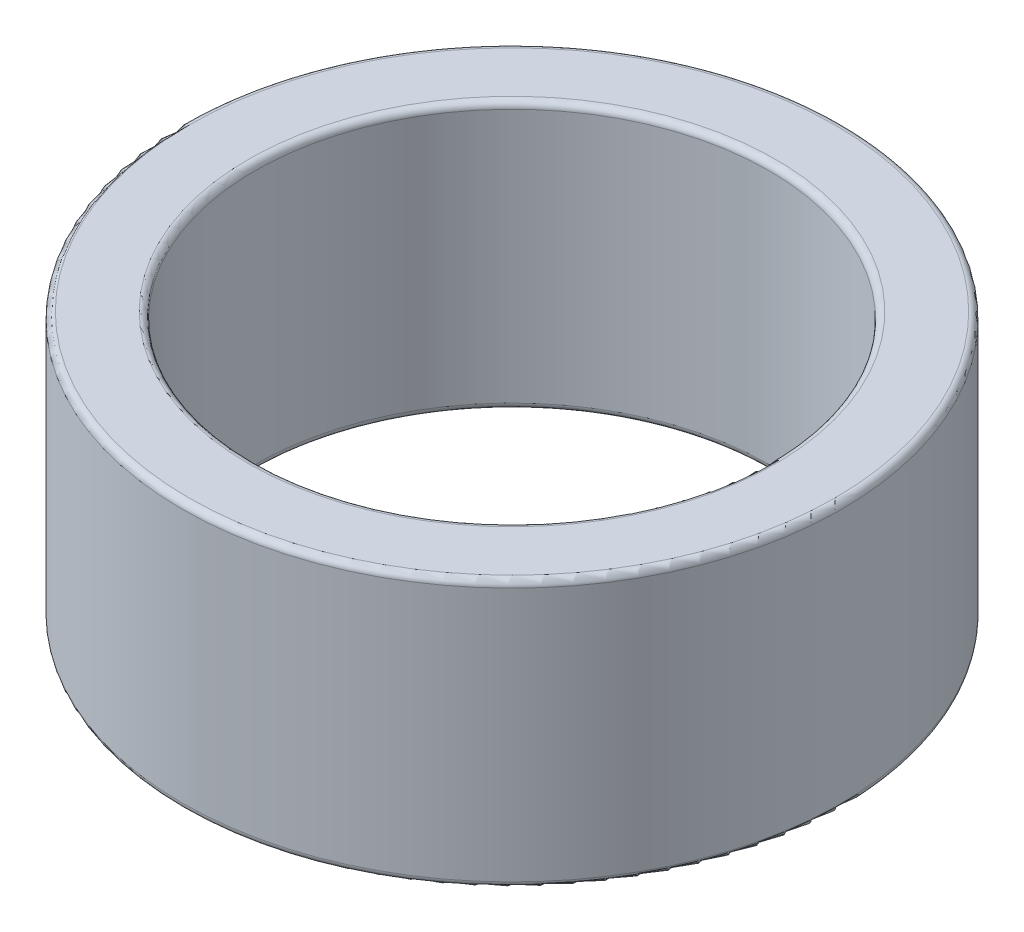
ISO-10303-21;
HEADER;
FILE_DESCRIPTION(('STEP AP214'),'2;1');
FILE_NAME('part.step','',(''),(''),'','','');
FILE_SCHEMA(('AUTOMOTIVE_DESIGN { 1 0 10303 214 1 1 1 1 }'));
ENDSEC;
DATA;
#1=APPLICATION_CONTEXT('core data for automotive mechanical design processes');
#2=APPLICATION_PROTOCOL_DEFINITION('international standard','automotive_design',2000,#1);
#3=PRODUCT_CONTEXT('',#1,'mechanical');
#4=PRODUCT('Part','Part','',(#3));
#5=PRODUCT_RELATED_PRODUCT_CATEGORY('part','',(#4));
#6=PRODUCT_DEFINITION_FORMATION('','',#4);
#7=PRODUCT_DEFINITION_CONTEXT('part definition',#1,'design');
#8=PRODUCT_DEFINITION('design','',#6,#7);
#9=PRODUCT_DEFINITION_SHAPE('','',#8);
#10=(LENGTH_UNIT() NAMED_UNIT(*) SI_UNIT(.MILLI.,.METRE.));
#11=(NAMED_UNIT(*) PLANE_ANGLE_UNIT() SI_UNIT($,.RADIAN.));
#12=(NAMED_UNIT(*) SI_UNIT($,.STERADIAN.) SOLID_ANGLE_UNIT());
#13=UNCERTAINTY_MEASURE_WITH_UNIT(LENGTH_MEASURE(1.E-05),#10,'distance_accuracy_value','');
#14=(GEOMETRIC_REPRESENTATION_CONTEXT(3) GLOBAL_UNCERTAINTY_ASSIGNED_CONTEXT((#13)) GLOBAL_UNIT_ASSIGNED_CONTEXT((#10,
#11,#12)) REPRESENTATION_CONTEXT('',''));
#15=CARTESIAN_POINT('',(0.,0.,0.));
#16=DIRECTION('',(0.,0.,1.));
#17=DIRECTION('',(1.,0.,0.));
#18=AXIS2_PLACEMENT_3D('',#15,#16,#17);
#19=CARTESIAN_POINT('',(0.,10.3124,0.));
#20=DIRECTION('',(0.,-1.,0.));
#21=DIRECTION('',(0.,0.,-1.));
#22=AXIS2_PLACEMENT_3D('',#19,#20,#21);
#23=CYLINDRICAL_SURFACE('',#22,12.7);
#24=CARTESIAN_POINT('',(0.,0.254000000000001,0.));
#25=DIRECTION('',(0.,1.,0.));
#26=DIRECTION('',(0.,0.,1.));
#27=AXIS2_PLACEMENT_3D('',#24,#25,#26);
#28=CIRCLE('',#27,12.7);
#29=CARTESIAN_POINT('',(0.,0.254000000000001,12.7));
#30=VERTEX_POINT('',#29);
#31=EDGE_CURVE('E59',#30,#30,#28,.T.);
#32=ORIENTED_EDGE('',*,*,#31,.T.);
#33=EDGE_LOOP('',(#32));
#34=FACE_BOUND('',#33,.T.);
#35=CARTESIAN_POINT('',(0.,10.0584,0.));
#36=DIRECTION('',(0.,1.,0.));
#37=DIRECTION('',(0.,0.,1.));
#38=AXIS2_PLACEMENT_3D('',#35,#36,#37);
#39=CIRCLE('',#38,12.7);
#40=CARTESIAN_POINT('',(0.,10.0584,12.7));
#41=VERTEX_POINT('',#40);
#42=EDGE_CURVE('E62',#41,#41,#39,.F.);
#43=ORIENTED_EDGE('',*,*,#42,.T.);
#44=EDGE_LOOP('',(#43));
#45=FACE_BOUND('',#44,.T.);
#46=ADVANCED_FACE('F34',(#34,#45),#23,.T.);
#47=CARTESIAN_POINT('',(0.,10.3124,0.));
#48=DIRECTION('',(0.,1.,0.));
#49=DIRECTION('',(0.,0.,1.));
#50=AXIS2_PLACEMENT_3D('',#47,#48,#49);
#51=PLANE('',#50);
#52=CARTESIAN_POINT('',(0.,10.3124,0.));
#53=DIRECTION('',(0.,1.,0.));
#54=DIRECTION('',(0.,0.,1.));
#55=AXIS2_PLACEMENT_3D('',#52,#53,#54);
#56=CIRCLE('',#55,10.16);
#57=CARTESIAN_POINT('',(0.,10.3124,10.16));
#58=VERTEX_POINT('',#57);
#59=EDGE_CURVE('E10',#58,#58,#56,.F.);
#60=ORIENTED_EDGE('',*,*,#59,.T.);
#61=EDGE_LOOP('',(#60));
#62=FACE_BOUND('',#61,.T.);
#63=CARTESIAN_POINT('',(0.,10.3124,0.));
#64=DIRECTION('',(0.,1.,0.));
#65=DIRECTION('',(0.,0.,1.));
#66=AXIS2_PLACEMENT_3D('',#63,#64,#65);
#67=CIRCLE('',#66,12.446);
#68=CARTESIAN_POINT('',(0.,10.3124,12.446));
#69=VERTEX_POINT('',#68);
#70=EDGE_CURVE('E40',#69,#69,#67,.T.);
#71=ORIENTED_EDGE('',*,*,#70,.T.);
#72=EDGE_LOOP('',(#71));
#73=FACE_BOUND('',#72,.T.);
#74=ADVANCED_FACE('F79',(#62,#73),#51,.T.);
#75=CARTESIAN_POINT('',(0.,0.,0.));
#76=DIRECTION('',(0.,1.,0.));
#77=DIRECTION('',(0.,0.,1.));
#78=AXIS2_PLACEMENT_3D('',#75,#76,#77);
#79=PLANE('',#78);
#80=CARTESIAN_POINT('',(0.,0.,0.));
#81=DIRECTION('',(0.,1.,0.));
#82=DIRECTION('',(0.,0.,1.));
#83=AXIS2_PLACEMENT_3D('',#80,#81,#82);
#84=CIRCLE('',#83,12.446);
#85=CARTESIAN_POINT('',(0.,0.,12.446));
#86=VERTEX_POINT('',#85);
#87=EDGE_CURVE('E53',#86,#86,#84,.F.);
#88=ORIENTED_EDGE('',*,*,#87,.T.);
#89=EDGE_LOOP('',(#88));
#90=FACE_BOUND('',#89,.T.);
#91=CARTESIAN_POINT('',(0.,0.,0.));
#92=DIRECTION('',(0.,1.,0.));
#93=DIRECTION('',(0.,0.,1.));
#94=AXIS2_PLACEMENT_3D('',#91,#92,#93);
#95=CIRCLE('',#94,10.16);
#96=CARTESIAN_POINT('',(0.,0.,10.16));
#97=VERTEX_POINT('',#96);
#98=EDGE_CURVE('E56',#97,#97,#95,.T.);
#99=ORIENTED_EDGE('',*,*,#98,.T.);
#100=EDGE_LOOP('',(#99));
#101=FACE_BOUND('',#100,.T.);
#102=ADVANCED_FACE('F84',(#90,#101),#79,.F.);
#103=CARTESIAN_POINT('',(0.,10.3124,0.));
#104=DIRECTION('',(0.,-1.,0.));
#105=DIRECTION('',(0.,0.,-1.));
#106=AXIS2_PLACEMENT_3D('',#103,#104,#105);
#107=CYLINDRICAL_SURFACE('',#106,9.906);
#108=CARTESIAN_POINT('',(0.,0.254000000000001,0.));
#109=DIRECTION('',(0.,1.,0.));
#110=DIRECTION('',(0.,0.,1.));
#111=AXIS2_PLACEMENT_3D('',#108,#109,#110);
#112=CIRCLE('',#111,9.906);
#113=CARTESIAN_POINT('',(0.,0.254000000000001,9.906));
#114=VERTEX_POINT('',#113);
#115=EDGE_CURVE('E44',#114,#114,#112,.F.);
#116=ORIENTED_EDGE('',*,*,#115,.T.);
#117=EDGE_LOOP('',(#116));
#118=FACE_BOUND('',#117,.T.);
#119=CARTESIAN_POINT('',(0.,10.0584,0.));
#120=DIRECTION('',(0.,1.,0.));
#121=DIRECTION('',(0.,0.,1.));
#122=AXIS2_PLACEMENT_3D('',#119,#120,#121);
#123=CIRCLE('',#122,9.906);
#124=CARTESIAN_POINT('',(0.,10.0584,9.906));
#125=VERTEX_POINT('',#124);
#126=EDGE_CURVE('E48',#125,#125,#123,.T.);
#127=ORIENTED_EDGE('',*,*,#126,.T.);
#128=EDGE_LOOP('',(#127));
#129=FACE_BOUND('',#128,.T.);
#130=ADVANCED_FACE('F89',(#118,#129),#107,.F.);
#131=CARTESIAN_POINT('',(0.,0.254000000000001,0.));
#132=DIRECTION('',(0.,1.,0.));
#133=DIRECTION('',(0.,0.,1.));
#134=AXIS2_PLACEMENT_3D('',#131,#132,#133);
#135=TOROIDAL_SURFACE('',#134,12.446,0.254);
#136=ORIENTED_EDGE('',*,*,#87,.F.);
#137=EDGE_LOOP('',(#136));
#138=FACE_BOUND('',#137,.T.);
#139=ORIENTED_EDGE('',*,*,#31,.F.);
#140=EDGE_LOOP('',(#139));
#141=FACE_BOUND('',#140,.T.);
#142=ADVANCED_FACE('F87',(#138,#141),#135,.T.);
#143=CARTESIAN_POINT('',(0.,0.254000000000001,0.));
#144=DIRECTION('',(0.,1.,0.));
#145=DIRECTION('',(0.,0.,1.));
#146=AXIS2_PLACEMENT_3D('',#143,#144,#145);
#147=TOROIDAL_SURFACE('',#146,10.16,0.254);
#148=ORIENTED_EDGE('',*,*,#98,.F.);
#149=EDGE_LOOP('',(#148));
#150=FACE_BOUND('',#149,.T.);
#151=ORIENTED_EDGE('',*,*,#115,.F.);
#152=EDGE_LOOP('',(#151));
#153=FACE_BOUND('',#152,.T.);
#154=ADVANCED_FACE('F75',(#150,#153),#147,.T.);
#155=CARTESIAN_POINT('',(0.,10.0584,0.));
#156=DIRECTION('',(0.,1.,0.));
#157=DIRECTION('',(0.,0.,1.));
#158=AXIS2_PLACEMENT_3D('',#155,#156,#157);
#159=TOROIDAL_SURFACE('',#158,10.16,0.254);
#160=ORIENTED_EDGE('',*,*,#126,.F.);
#161=EDGE_LOOP('',(#160));
#162=FACE_BOUND('',#161,.T.);
#163=ORIENTED_EDGE('',*,*,#59,.F.);
#164=EDGE_LOOP('',(#163));
#165=FACE_BOUND('',#164,.T.);
#166=ADVANCED_FACE('F70',(#162,#165),#159,.T.);
#167=CARTESIAN_POINT('',(0.,10.0584,0.));
#168=DIRECTION('',(0.,1.,0.));
#169=DIRECTION('',(0.,0.,1.));
#170=AXIS2_PLACEMENT_3D('',#167,#168,#169);
#171=TOROIDAL_SURFACE('',#170,12.446,0.254);
#172=ORIENTED_EDGE('',*,*,#42,.F.);
#173=EDGE_LOOP('',(#172));
#174=FACE_BOUND('',#173,.T.);
#175=ORIENTED_EDGE('',*,*,#70,.F.);
#176=EDGE_LOOP('',(#175));
#177=FACE_BOUND('',#176,.T.);
#178=ADVANCED_FACE('F67',(#174,#177),#171,.T.);
#179=CLOSED_SHELL('',(#46,#74,#102,#130,#142,#154,#166,#178));
#180=MANIFOLD_SOLID_BREP('B2',#179);
#181=ADVANCED_BREP_SHAPE_REPRESENTATION('',(#18,#180),#14);
#182=SHAPE_DEFINITION_REPRESENTATION(#9,#181);
ENDSEC;
END-ISO-10303-21;
